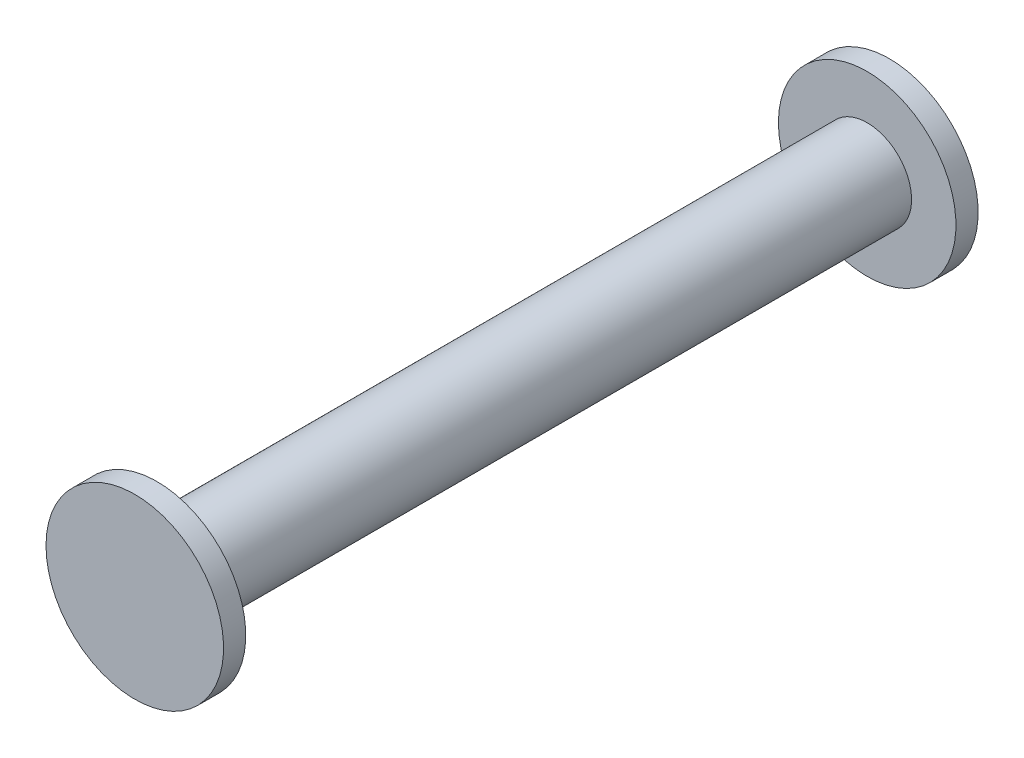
ISO-10303-21;
HEADER;
FILE_DESCRIPTION(('STEP AP214'),'2;1');
FILE_NAME('part.step','',(''),(''),'','','');
FILE_SCHEMA(('AUTOMOTIVE_DESIGN { 1 0 10303 214 1 1 1 1 }'));
ENDSEC;
DATA;
#1=APPLICATION_CONTEXT('core data for automotive mechanical design processes');
#2=APPLICATION_PROTOCOL_DEFINITION('international standard','automotive_design',2000,#1);
#3=PRODUCT_CONTEXT('',#1,'mechanical');
#4=PRODUCT('Part','Part','',(#3));
#5=PRODUCT_RELATED_PRODUCT_CATEGORY('part','',(#4));
#6=PRODUCT_DEFINITION_FORMATION('','',#4);
#7=PRODUCT_DEFINITION_CONTEXT('part definition',#1,'design');
#8=PRODUCT_DEFINITION('design','',#6,#7);
#9=PRODUCT_DEFINITION_SHAPE('','',#8);
#10=(LENGTH_UNIT() NAMED_UNIT(*) SI_UNIT(.MILLI.,.METRE.));
#11=(NAMED_UNIT(*) PLANE_ANGLE_UNIT() SI_UNIT($,.RADIAN.));
#12=(NAMED_UNIT(*) SI_UNIT($,.STERADIAN.) SOLID_ANGLE_UNIT());
#13=UNCERTAINTY_MEASURE_WITH_UNIT(LENGTH_MEASURE(1.E-05),#10,'distance_accuracy_value','');
#14=(GEOMETRIC_REPRESENTATION_CONTEXT(3) GLOBAL_UNCERTAINTY_ASSIGNED_CONTEXT((#13)) GLOBAL_UNIT_ASSIGNED_CONTEXT((#10,
#11,#12)) REPRESENTATION_CONTEXT('',''));
#15=CARTESIAN_POINT('',(0.,0.,0.));
#16=DIRECTION('',(0.,0.,1.));
#17=DIRECTION('',(1.,0.,0.));
#18=AXIS2_PLACEMENT_3D('',#15,#16,#17);
#19=CARTESIAN_POINT('',(0.,0.,-17.));
#20=DIRECTION('',(0.,0.,1.));
#21=DIRECTION('',(1.,0.,0.));
#22=AXIS2_PLACEMENT_3D('',#19,#20,#21);
#23=PLANE('',#22);
#24=CARTESIAN_POINT('',(0.,0.,-17.));
#25=DIRECTION('',(0.,0.,-1.));
#26=DIRECTION('',(-1.,0.,0.));
#27=AXIS2_PLACEMENT_3D('',#24,#25,#26);
#28=CIRCLE('',#27,2.);
#29=CARTESIAN_POINT('',(-2.,0.,-17.));
#30=VERTEX_POINT('',#29);
#31=EDGE_CURVE('E10',#30,#30,#28,.T.);
#32=ORIENTED_EDGE('',*,*,#31,.T.);
#33=EDGE_LOOP('',(#32));
#34=FACE_BOUND('',#33,.T.);
#35=ADVANCED_FACE('F24',(#34),#23,.F.);
#36=CARTESIAN_POINT('',(0.,0.,-31.3647024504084));
#37=DIRECTION('',(0.,0.,-1.));
#38=DIRECTION('',(-1.,0.,0.));
#39=AXIS2_PLACEMENT_3D('',#36,#37,#38);
#40=CYLINDRICAL_SURFACE('',#39,2.);
#41=ORIENTED_EDGE('',*,*,#31,.F.);
#42=EDGE_LOOP('',(#41));
#43=FACE_BOUND('',#42,.T.);
#44=CARTESIAN_POINT('',(0.,0.,-16.5));
#45=DIRECTION('',(0.,0.,-1.));
#46=DIRECTION('',(-1.,0.,0.));
#47=AXIS2_PLACEMENT_3D('',#44,#45,#46);
#48=CIRCLE('',#47,2.);
#49=CARTESIAN_POINT('',(-2.,0.,-16.5));
#50=VERTEX_POINT('',#49);
#51=EDGE_CURVE('E30',#50,#50,#48,.T.);
#52=ORIENTED_EDGE('',*,*,#51,.T.);
#53=EDGE_LOOP('',(#52));
#54=FACE_BOUND('',#53,.T.);
#55=ADVANCED_FACE('F62',(#43,#54),#40,.T.);
#56=CARTESIAN_POINT('',(2.,0.,-16.5));
#57=DIRECTION('',(0.,0.,-1.));
#58=DIRECTION('',(-1.,0.,0.));
#59=AXIS2_PLACEMENT_3D('',#56,#57,#58);
#60=PLANE('',#59);
#61=ORIENTED_EDGE('',*,*,#51,.F.);
#62=EDGE_LOOP('',(#61));
#63=FACE_BOUND('',#62,.T.);
#64=CARTESIAN_POINT('',(0.,0.,-16.5));
#65=DIRECTION('',(0.,0.,-1.));
#66=DIRECTION('',(-1.,0.,0.));
#67=AXIS2_PLACEMENT_3D('',#64,#65,#66);
#68=CIRCLE('',#67,1.);
#69=CARTESIAN_POINT('',(-1.,0.,-16.5));
#70=VERTEX_POINT('',#69);
#71=EDGE_CURVE('E34',#70,#70,#68,.T.);
#72=ORIENTED_EDGE('',*,*,#71,.T.);
#73=EDGE_LOOP('',(#72));
#74=FACE_BOUND('',#73,.T.);
#75=ADVANCED_FACE('F66',(#63,#74),#60,.F.);
#76=CARTESIAN_POINT('',(0.,0.,-31.3647024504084));
#77=DIRECTION('',(0.,0.,-1.));
#78=DIRECTION('',(-1.,0.,0.));
#79=AXIS2_PLACEMENT_3D('',#76,#77,#78);
#80=CYLINDRICAL_SURFACE('',#79,1.);
#81=ORIENTED_EDGE('',*,*,#71,.F.);
#82=EDGE_LOOP('',(#81));
#83=FACE_BOUND('',#82,.T.);
#84=CARTESIAN_POINT('',(0.,0.,-0.5));
#85=DIRECTION('',(0.,0.,-1.));
#86=DIRECTION('',(-1.,0.,0.));
#87=AXIS2_PLACEMENT_3D('',#84,#85,#86);
#88=CIRCLE('',#87,1.);
#89=CARTESIAN_POINT('',(-1.,0.,-0.5));
#90=VERTEX_POINT('',#89);
#91=EDGE_CURVE('E38',#90,#90,#88,.T.);
#92=ORIENTED_EDGE('',*,*,#91,.T.);
#93=EDGE_LOOP('',(#92));
#94=FACE_BOUND('',#93,.T.);
#95=ADVANCED_FACE('F71',(#83,#94),#80,.T.);
#96=CARTESIAN_POINT('',(1.,0.,-0.5));
#97=DIRECTION('',(0.,0.,1.));
#98=DIRECTION('',(1.,0.,0.));
#99=AXIS2_PLACEMENT_3D('',#96,#97,#98);
#100=PLANE('',#99);
#101=ORIENTED_EDGE('',*,*,#91,.F.);
#102=EDGE_LOOP('',(#101));
#103=FACE_BOUND('',#102,.T.);
#104=CARTESIAN_POINT('',(0.,0.,-0.5));
#105=DIRECTION('',(0.,0.,-1.));
#106=DIRECTION('',(-1.,0.,0.));
#107=AXIS2_PLACEMENT_3D('',#104,#105,#106);
#108=CIRCLE('',#107,2.);
#109=CARTESIAN_POINT('',(-2.,0.,-0.5));
#110=VERTEX_POINT('',#109);
#111=EDGE_CURVE('E43',#110,#110,#108,.T.);
#112=ORIENTED_EDGE('',*,*,#111,.T.);
#113=EDGE_LOOP('',(#112));
#114=FACE_BOUND('',#113,.T.);
#115=ADVANCED_FACE('F58',(#103,#114),#100,.F.);
#116=CARTESIAN_POINT('',(0.,0.,-31.3647024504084));
#117=DIRECTION('',(0.,0.,-1.));
#118=DIRECTION('',(-1.,0.,0.));
#119=AXIS2_PLACEMENT_3D('',#116,#117,#118);
#120=CYLINDRICAL_SURFACE('',#119,2.);
#121=ORIENTED_EDGE('',*,*,#111,.F.);
#122=EDGE_LOOP('',(#121));
#123=FACE_BOUND('',#122,.T.);
#124=CARTESIAN_POINT('',(0.,0.,0.));
#125=DIRECTION('',(0.,0.,-1.));
#126=DIRECTION('',(-1.,0.,0.));
#127=AXIS2_PLACEMENT_3D('',#124,#125,#126);
#128=CIRCLE('',#127,2.);
#129=CARTESIAN_POINT('',(-2.,0.,0.));
#130=VERTEX_POINT('',#129);
#131=EDGE_CURVE('E46',#130,#130,#128,.T.);
#132=ORIENTED_EDGE('',*,*,#131,.T.);
#133=EDGE_LOOP('',(#132));
#134=FACE_BOUND('',#133,.T.);
#135=ADVANCED_FACE('F50',(#123,#134),#120,.T.);
#136=CARTESIAN_POINT('',(2.,0.,0.));
#137=DIRECTION('',(0.,0.,-1.));
#138=DIRECTION('',(-1.,0.,0.));
#139=AXIS2_PLACEMENT_3D('',#136,#137,#138);
#140=PLANE('',#139);
#141=ORIENTED_EDGE('',*,*,#131,.F.);
#142=EDGE_LOOP('',(#141));
#143=FACE_BOUND('',#142,.T.);
#144=ADVANCED_FACE('F52',(#143),#140,.F.);
#145=CLOSED_SHELL('',(#35,#55,#75,#95,#115,#135,#144));
#146=MANIFOLD_SOLID_BREP('B2',#145);
#147=ADVANCED_BREP_SHAPE_REPRESENTATION('',(#18,#146),#14);
#148=SHAPE_DEFINITION_REPRESENTATION(#9,#147);
ENDSEC;
END-ISO-10303-21;
